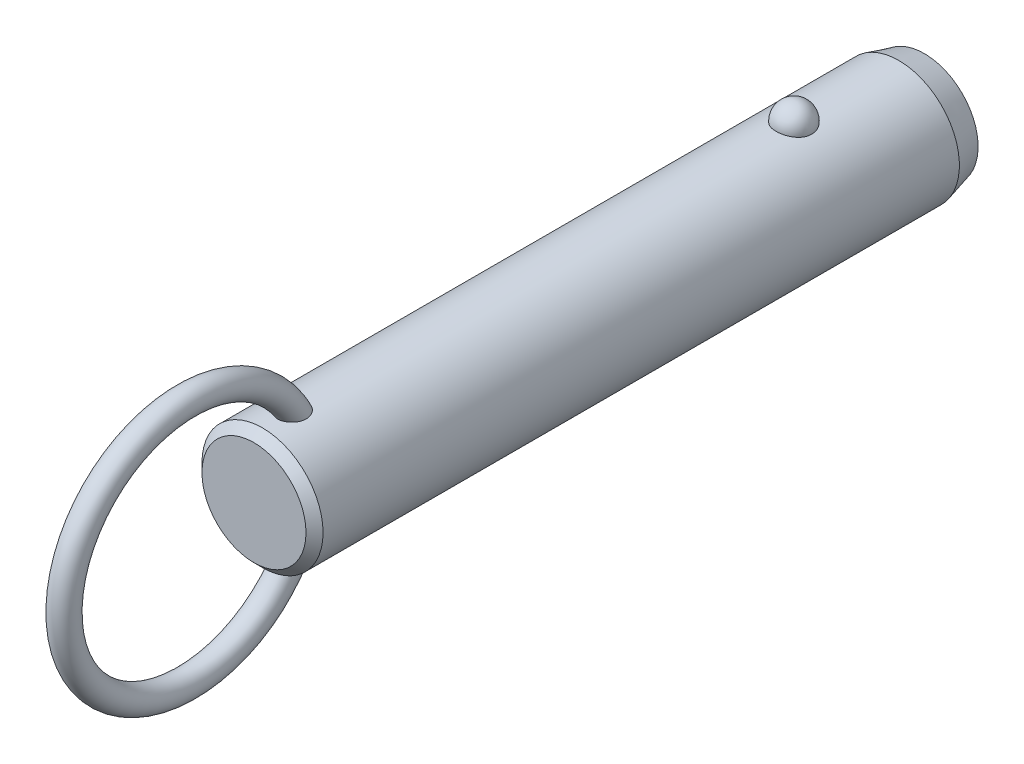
ISO-10303-21;
HEADER;
FILE_DESCRIPTION(('STEP AP214'),'2;1');
FILE_NAME('part.step','',(''),(''),'','','');
FILE_SCHEMA(('AUTOMOTIVE_DESIGN { 1 0 10303 214 1 1 1 1 }'));
ENDSEC;
DATA;
#1=APPLICATION_CONTEXT('core data for automotive mechanical design processes');
#2=APPLICATION_PROTOCOL_DEFINITION('international standard','automotive_design',2000,#1);
#3=PRODUCT_CONTEXT('',#1,'mechanical');
#4=PRODUCT('Part','Part','',(#3));
#5=PRODUCT_RELATED_PRODUCT_CATEGORY('part','',(#4));
#6=PRODUCT_DEFINITION_FORMATION('','',#4);
#7=PRODUCT_DEFINITION_CONTEXT('part definition',#1,'design');
#8=PRODUCT_DEFINITION('design','',#6,#7);
#9=PRODUCT_DEFINITION_SHAPE('','',#8);
#10=(LENGTH_UNIT() NAMED_UNIT(*) SI_UNIT(.MILLI.,.METRE.));
#11=(NAMED_UNIT(*) PLANE_ANGLE_UNIT() SI_UNIT($,.RADIAN.));
#12=(NAMED_UNIT(*) SI_UNIT($,.STERADIAN.) SOLID_ANGLE_UNIT());
#13=UNCERTAINTY_MEASURE_WITH_UNIT(LENGTH_MEASURE(1.E-05),#10,'distance_accuracy_value','');
#14=(GEOMETRIC_REPRESENTATION_CONTEXT(3) GLOBAL_UNCERTAINTY_ASSIGNED_CONTEXT((#13)) GLOBAL_UNIT_ASSIGNED_CONTEXT((#10,
#11,#12)) REPRESENTATION_CONTEXT('',''));
#15=CARTESIAN_POINT('',(0.,0.,0.));
#16=DIRECTION('',(0.,0.,1.));
#17=DIRECTION('',(1.,0.,0.));
#18=AXIS2_PLACEMENT_3D('',#15,#16,#17);
#19=CARTESIAN_POINT('',(0.,0.,53.3));
#20=DIRECTION('',(0.,0.,-1.));
#21=DIRECTION('',(-1.,0.,0.));
#22=AXIS2_PLACEMENT_3D('',#19,#20,#21);
#23=CYLINDRICAL_SURFACE('',#22,7.1);
#24=CARTESIAN_POINT('',(2.0769088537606,6.78943661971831,-2.1));
#25=CARTESIAN_POINT('',(2.07690739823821,6.78943796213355,-1.98268154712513));
#26=CARTESIAN_POINT('',(2.06738130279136,6.79237331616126,-1.86534506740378));
#27=CARTESIAN_POINT('',(2.0295040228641,6.8037853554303,-1.63400788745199));
#28=CARTESIAN_POINT('',(2.00114757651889,6.81226358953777,-1.52000812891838));
#29=CARTESIAN_POINT('',(1.92632025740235,6.83379798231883,-1.29863433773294));
#30=CARTESIAN_POINT('',(1.87985726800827,6.84685214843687,-1.19125744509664));
#31=CARTESIAN_POINT('',(1.76995205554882,6.87608091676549,-0.98604657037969));
#32=CARTESIAN_POINT('',(1.70650980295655,6.8922555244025,-0.88821260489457));
#33=CARTESIAN_POINT('',(1.5638119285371,6.92602930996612,-0.704242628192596));
#34=CARTESIAN_POINT('',(1.4844714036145,6.94363582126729,-0.618173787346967));
#35=CARTESIAN_POINT('',(1.31221746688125,6.97823658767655,-0.460740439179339));
#36=CARTESIAN_POINT('',(1.21930409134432,6.99523084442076,-0.389375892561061));
#37=CARTESIAN_POINT('',(1.02268781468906,7.02666176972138,-0.263547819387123));
#38=CARTESIAN_POINT('',(0.91902009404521,7.04110638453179,-0.209031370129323));
#39=CARTESIAN_POINT('',(0.703548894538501,7.06588726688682,-0.118163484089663));
#40=CARTESIAN_POINT('',(0.591746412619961,7.07622403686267,-0.0818098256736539));
#41=CARTESIAN_POINT('',(0.365557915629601,7.09147068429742,-0.0288711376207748));
#42=CARTESIAN_POINT('',(0.251267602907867,7.09648447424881,-0.0119070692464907));
#43=CARTESIAN_POINT('',(0.0213499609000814,7.10089837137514,0.00304925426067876));
#44=CARTESIAN_POINT('',(-0.0942772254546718,7.10029907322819,0.00104351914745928));
#45=CARTESIAN_POINT('',(-0.321651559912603,7.09360829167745,-0.0216931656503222));
#46=CARTESIAN_POINT('',(-0.433431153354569,7.08760388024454,-0.0421272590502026));
#47=CARTESIAN_POINT('',(-0.651862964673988,7.07086131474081,-0.100729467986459));
#48=CARTESIAN_POINT('',(-0.758515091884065,7.06012307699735,-0.138897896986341));
#49=CARTESIAN_POINT('',(-0.964449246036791,7.03496097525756,-0.232213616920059));
#50=CARTESIAN_POINT('',(-1.06368095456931,7.02051445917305,-0.287465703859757));
#51=CARTESIAN_POINT('',(-1.25145353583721,6.98948740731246,-0.413383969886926));
#52=CARTESIAN_POINT('',(-1.33999321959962,6.97290663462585,-0.48405186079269));
#53=CARTESIAN_POINT('',(-1.50591604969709,6.93898770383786,-0.640594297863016));
#54=CARTESIAN_POINT('',(-1.58302488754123,6.92164094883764,-0.726757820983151));
#55=CARTESIAN_POINT('',(-1.72189320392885,6.8884103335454,-0.91092752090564));
#56=CARTESIAN_POINT('',(-1.78365144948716,6.87252659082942,-1.008934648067));
#57=CARTESIAN_POINT('',(-1.89101272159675,6.84377189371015,-1.21549497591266));
#58=CARTESIAN_POINT('',(-1.93639553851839,6.83094274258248,-1.32416860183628));
#59=CARTESIAN_POINT('',(-2.00874275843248,6.81002070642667,-1.54791500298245));
#60=CARTESIAN_POINT('',(-2.03570774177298,6.80192767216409,-1.66298757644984));
#61=CARTESIAN_POINT('',(-2.07047276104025,6.7914266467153,-1.89571453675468));
#62=CARTESIAN_POINT('',(-2.07835878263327,6.78899315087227,-2.01335491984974));
#63=CARTESIAN_POINT('',(-2.07502083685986,6.79001409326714,-2.24833570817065));
#64=CARTESIAN_POINT('',(-2.06379746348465,6.7934683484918,-2.36567612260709));
#65=CARTESIAN_POINT('',(-2.02263913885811,6.80583442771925,-2.59603194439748));
#66=CARTESIAN_POINT('',(-1.99281127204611,6.81471501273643,-2.70906820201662));
#67=CARTESIAN_POINT('',(-1.91526639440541,6.83691232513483,-2.92836575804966));
#68=CARTESIAN_POINT('',(-1.8675486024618,6.85022924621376,-3.03462676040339));
#69=CARTESIAN_POINT('',(-1.75504492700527,6.87991336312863,-3.23806487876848));
#70=CARTESIAN_POINT('',(-1.69015924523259,6.89629822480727,-3.33518422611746));
#71=CARTESIAN_POINT('',(-1.54505404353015,6.93024852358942,-3.51697105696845));
#72=CARTESIAN_POINT('',(-1.46483385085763,6.94781401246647,-3.60163799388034));
#73=CARTESIAN_POINT('',(-1.29071406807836,6.98225977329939,-3.75654119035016));
#74=CARTESIAN_POINT('',(-1.19675650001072,6.99913673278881,-3.82671308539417));
#75=CARTESIAN_POINT('',(-0.997940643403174,7.03023618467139,-3.9501837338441));
#76=CARTESIAN_POINT('',(-0.89308318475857,7.04445887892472,-4.00348377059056));
#77=CARTESIAN_POINT('',(-0.676902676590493,7.06848365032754,-4.09107242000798));
#78=CARTESIAN_POINT('',(-0.565686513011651,7.0783430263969,-4.12560889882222));
#79=CARTESIAN_POINT('',(-0.338739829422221,7.09282534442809,-4.17575450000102));
#80=CARTESIAN_POINT('',(-0.223009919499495,7.09744899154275,-4.19136617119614));
#81=CARTESIAN_POINT('',(0.00707628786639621,7.10090930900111,-4.20307965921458));
#82=CARTESIAN_POINT('',(0.121410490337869,7.09986531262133,-4.19958377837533));
#83=CARTESIAN_POINT('',(0.347815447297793,7.092380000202,-4.17411564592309));
#84=CARTESIAN_POINT('',(0.459886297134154,7.08593891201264,-4.15214417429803));
#85=CARTESIAN_POINT('',(0.678084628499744,7.06838983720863,-4.09049562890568));
#86=CARTESIAN_POINT('',(0.784237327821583,7.05730369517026,-4.05090137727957));
#87=CARTESIAN_POINT('',(0.988305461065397,7.03163139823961,-3.95511447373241));
#88=CARTESIAN_POINT('',(1.08622031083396,7.01704499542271,-3.89892064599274));
#89=CARTESIAN_POINT('',(1.27284490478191,6.98562668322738,-3.77035541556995));
#90=CARTESIAN_POINT('',(1.36137372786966,6.96876135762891,-3.69772964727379));
#91=CARTESIAN_POINT('',(1.52509486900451,6.93477412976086,-3.53878279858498));
#92=CARTESIAN_POINT('',(1.60028496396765,6.91765218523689,-3.45245943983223));
#93=CARTESIAN_POINT('',(1.73681688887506,6.88465753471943,-3.26658774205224));
#94=CARTESIAN_POINT('',(1.79785966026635,6.86881574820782,-3.16681408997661));
#95=CARTESIAN_POINT('',(1.90265327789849,6.84053157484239,-2.95814408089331));
#96=CARTESIAN_POINT('',(1.94640861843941,6.82808830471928,-2.84925010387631));
#97=CARTESIAN_POINT('',(2.01274378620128,6.80881460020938,-2.63454318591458));
#98=CARTESIAN_POINT('',(2.03676193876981,6.80160856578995,-2.52920574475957));
#99=CARTESIAN_POINT('',(2.06884490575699,6.79191902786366,-2.3159172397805));
#100=CARTESIAN_POINT('',(2.07691019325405,6.78943538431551,-2.20796625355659));
#101=CARTESIAN_POINT('',(2.0769088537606,6.78943661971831,-2.1));
#102=B_SPLINE_CURVE_WITH_KNOTS('',3,(#24,#25,#26,#27,#28,#29,#30,#31,#32,#33,#34,#35,#36,#37,
#38,#39,#40,#41,#42,#43,#44,#45,#46,#47,#48,#49,#50,#51,#52,#53,#54,#55,#56,#57,#58,#59,#60,#61,
#62,#63,#64,#65,#66,#67,#68,#69,#70,#71,#72,#73,#74,#75,#76,#77,#78,#79,#80,#81,#82,#83,#84,#85,
#86,#87,#88,#89,#90,#91,#92,#93,#94,#95,#96,#97,#98,#99,#100,#101),.UNSPECIFIED.,.T.,.F.,(4,2,2,
2,2,2,2,2,2,2,2,2,2,2,2,2,2,2,2,2,2,2,2,2,2,2,2,2,2,2,2,2,2,2,2,2,2,2,4),(0.,0.351568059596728,
0.703234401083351,1.05474780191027,1.40626181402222,1.75970563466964,2.11314851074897,
2.4654696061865,2.81774759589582,3.16301449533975,3.50824481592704,3.84801136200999,
4.18778391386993,4.52968352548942,4.87162112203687,5.22076181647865,5.56993054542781,
5.92363364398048,6.27732559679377,6.62942052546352,6.98150450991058,7.33158042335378,
7.68167162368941,8.03384443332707,8.38603269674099,8.73975272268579,9.09344583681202,
9.44234545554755,9.79119807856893,10.1327344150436,10.4742563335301,10.8141898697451,
11.1541474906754,11.4997793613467,11.8454687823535,12.1979079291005,12.5502553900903,
12.8738073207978,13.1973496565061),.UNSPECIFIED.);
#103=CARTESIAN_POINT('',(2.0769088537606,6.78943661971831,-2.1));
#104=VERTEX_POINT('',#103);
#105=EDGE_CURVE('E41',#104,#104,#102,.T.);
#106=ORIENTED_EDGE('',*,*,#105,.T.);
#107=EDGE_LOOP('',(#106));
#108=FACE_BOUND('',#107,.T.);
#109=CARTESIAN_POINT('',(0.,0.,60.22));
#110=DIRECTION('',(0.,0.,1.));
#111=DIRECTION('',(1.,0.,0.));
#112=AXIS2_PLACEMENT_3D('',#109,#110,#111);
#113=CIRCLE('',#112,7.1);
#114=CARTESIAN_POINT('',(7.1,0.,60.22));
#115=VERTEX_POINT('',#114);
#116=EDGE_CURVE('E10',#115,#115,#113,.F.);
#117=ORIENTED_EDGE('',*,*,#116,.T.);
#118=EDGE_LOOP('',(#117));
#119=FACE_BOUND('',#118,.T.);
#120=CARTESIAN_POINT('',(-0.429539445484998,-7.08699541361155,55.0429212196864));
#121=CARTESIAN_POINT('',(-0.50833166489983,-7.08221999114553,55.0668764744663));
#122=CARTESIAN_POINT('',(-0.585039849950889,-7.07624016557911,55.0974570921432));
#123=CARTESIAN_POINT('',(-0.732082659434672,-7.06254296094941,55.1710242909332));
#124=CARTESIAN_POINT('',(-0.802417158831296,-7.05482554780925,55.2140111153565));
#125=CARTESIAN_POINT('',(-0.934722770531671,-7.03851844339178,55.3111135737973));
#126=CARTESIAN_POINT('',(-0.996700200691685,-7.02992941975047,55.3652207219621));
#127=CARTESIAN_POINT('',(-1.11079942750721,-7.01280697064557,55.4829676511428));
#128=CARTESIAN_POINT('',(-1.16292136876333,-7.00427354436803,55.5466072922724));
#129=CARTESIAN_POINT('',(-1.25705660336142,-6.98799959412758,55.6826870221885));
#130=CARTESIAN_POINT('',(-1.29888032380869,-6.98027525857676,55.7552598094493));
#131=CARTESIAN_POINT('',(-1.37069920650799,-6.96652886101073,55.9061686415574));
#132=CARTESIAN_POINT('',(-1.40069157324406,-6.96050720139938,55.9845060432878));
#133=CARTESIAN_POINT('',(-1.45043507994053,-6.95031881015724,56.1501903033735));
#134=CARTESIAN_POINT('',(-1.46937115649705,-6.94630231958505,56.2377897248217));
#135=CARTESIAN_POINT('',(-1.49424917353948,-6.94099239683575,56.4148714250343));
#136=CARTESIAN_POINT('',(-1.50018601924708,-6.93970003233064,56.5043544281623));
#137=CARTESIAN_POINT('',(-1.49978214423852,-6.93978815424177,56.6940607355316));
#138=CARTESIAN_POINT('',(-1.49187639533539,-6.94150934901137,56.794279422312));
#139=CARTESIAN_POINT('',(-1.46177925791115,-6.94790814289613,56.9924798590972));
#140=CARTESIAN_POINT('',(-1.43957541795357,-6.95258831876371,57.090459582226));
#141=CARTESIAN_POINT('',(-1.37783293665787,-6.96510647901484,57.2953629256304));
#142=CARTESIAN_POINT('',(-1.33634073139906,-6.97328848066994,57.4016801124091));
#143=CARTESIAN_POINT('',(-1.23686994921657,-6.99161706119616,57.6061777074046));
#144=CARTESIAN_POINT('',(-1.17889192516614,-7.00176357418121,57.7043583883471));
#145=CARTESIAN_POINT('',(-1.0587512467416,-7.02082898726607,57.8723743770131));
#146=CARTESIAN_POINT('',(-0.999247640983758,-7.02963746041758,57.9441230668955));
#147=CARTESIAN_POINT('',(-0.86949477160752,-7.04686074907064,58.0771959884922));
#148=CARTESIAN_POINT('',(-0.799263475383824,-7.05527619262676,58.1385372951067));
#149=CARTESIAN_POINT('',(-0.665408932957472,-7.06899457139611,58.2351316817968));
#150=CARTESIAN_POINT('',(-0.603817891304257,-7.07457275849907,58.2731512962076));
#151=CARTESIAN_POINT('',(-0.475172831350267,-7.08437420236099,58.3387581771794));
#152=CARTESIAN_POINT('',(-0.40812301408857,-7.08859848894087,58.3663533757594));
#153=CARTESIAN_POINT('',(-0.269431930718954,-7.09522749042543,58.4092569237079));
#154=CARTESIAN_POINT('',(-0.197757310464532,-7.09761688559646,58.4244618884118));
#155=CARTESIAN_POINT('',(-0.0527849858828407,-7.10017268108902,58.4407168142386));
#156=CARTESIAN_POINT('',(0.0205115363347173,-7.10034065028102,58.4417767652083));
#157=CARTESIAN_POINT('',(0.156426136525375,-7.09855986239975,58.4304619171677));
#158=CARTESIAN_POINT('',(0.219199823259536,-7.09688191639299,58.4198060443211));
#159=CARTESIAN_POINT('',(0.342134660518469,-7.09201880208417,58.3885379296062));
#160=CARTESIAN_POINT('',(0.402295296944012,-7.08883333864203,58.3679237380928));
#161=CARTESIAN_POINT('',(0.520687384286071,-7.08113868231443,58.3172125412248));
#162=CARTESIAN_POINT('',(0.578791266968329,-7.07658958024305,58.2868272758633));
#163=CARTESIAN_POINT('',(0.690173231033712,-7.06659708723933,58.2183678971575));
#164=CARTESIAN_POINT('',(0.743447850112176,-7.061153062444,58.1802883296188));
#165=CARTESIAN_POINT('',(0.870947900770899,-7.04680292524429,58.0765929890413));
#166=CARTESIAN_POINT('',(0.941828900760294,-7.0375580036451,58.0068972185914));
#167=CARTESIAN_POINT('',(1.07136606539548,-7.01900793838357,57.8569450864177));
#168=CARTESIAN_POINT('',(1.13000013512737,-7.00970271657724,57.7766700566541));
#169=CARTESIAN_POINT('',(1.23579584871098,-6.99183327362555,57.6068997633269));
#170=CARTESIAN_POINT('',(1.2827427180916,-6.98328455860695,57.5172696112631));
#171=CARTESIAN_POINT('',(1.36351442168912,-6.96796352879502,57.3321763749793));
#172=CARTESIAN_POINT('',(1.39733971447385,-6.96119115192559,57.2367134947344));
#173=CARTESIAN_POINT('',(1.45579181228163,-6.94922464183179,57.0253092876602));
#174=CARTESIAN_POINT('',(1.47790145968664,-6.94449000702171,56.908631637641));
#175=CARTESIAN_POINT('',(1.50168752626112,-6.93938731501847,56.6730153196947));
#176=CARTESIAN_POINT('',(1.50336085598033,-6.93901991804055,56.5540763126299));
#177=CARTESIAN_POINT('',(1.48486516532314,-6.9430010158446,56.3236079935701));
#178=CARTESIAN_POINT('',(1.46573441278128,-6.9471253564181,56.211995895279));
#179=CARTESIAN_POINT('',(1.40606892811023,-6.95944667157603,55.9948868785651));
#180=CARTESIAN_POINT('',(1.36556446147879,-6.96763788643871,55.8893815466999));
#181=CARTESIAN_POINT('',(1.27082700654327,-6.98548038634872,55.7042879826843));
#182=CARTESIAN_POINT('',(1.21949810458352,-6.99473841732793,55.6231719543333));
#183=CARTESIAN_POINT('',(1.10242050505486,-7.01414069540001,55.4722278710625));
#184=CARTESIAN_POINT('',(1.03668119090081,-7.02428436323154,55.4023925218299));
#185=CARTESIAN_POINT('',(0.90055902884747,-7.04295285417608,55.2835735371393));
#186=CARTESIAN_POINT('',(0.831428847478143,-7.05153466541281,55.2331573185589));
#187=CARTESIAN_POINT('',(0.685291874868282,-7.06723150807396,55.1451429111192));
#188=CARTESIAN_POINT('',(0.608287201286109,-7.0743469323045,55.1075412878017));
#189=CARTESIAN_POINT('',(0.451878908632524,-7.08602232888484,55.0474915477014));
#190=CARTESIAN_POINT('',(0.372686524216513,-7.09067127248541,55.0245088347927));
#191=CARTESIAN_POINT('',(0.211477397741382,-7.09730788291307,54.9920357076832));
#192=CARTESIAN_POINT('',(0.129460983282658,-7.09929585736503,54.9825437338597));
#193=CARTESIAN_POINT('',(-0.0332905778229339,-7.10037858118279,54.9773517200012));
#194=CARTESIAN_POINT('',(-0.114016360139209,-7.09953334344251,54.9813656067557));
#195=CARTESIAN_POINT('',(-0.273670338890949,-7.09517338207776,55.0024540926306));
#196=CARTESIAN_POINT('',(-0.352598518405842,-7.09165863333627,55.0195288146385));
#197=CARTESIAN_POINT('',(-0.429539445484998,-7.08699541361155,55.0429212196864));
#198=B_SPLINE_CURVE_WITH_KNOTS('',3,(#120,#121,#122,#123,#124,#125,#126,#127,#128,#129,#130,
#131,#132,#133,#134,#135,#136,#137,#138,#139,#140,#141,#142,#143,#144,#145,#146,#147,#148,#149,
#150,#151,#152,#153,#154,#155,#156,#157,#158,#159,#160,#161,#162,#163,#164,#165,#166,#167,#168,
#169,#170,#171,#172,#173,#174,#175,#176,#177,#178,#179,#180,#181,#182,#183,#184,#185,#186,#187,
#188,#189,#190,#191,#192,#193,#194,#195,#196,#197),.UNSPECIFIED.,.T.,.F.,(4,2,2,2,2,2,2,2,2,2,2,
2,2,2,2,2,2,2,2,2,2,2,2,2,2,2,2,2,2,2,2,2,2,2,2,2,2,2,4),(0.,0.247183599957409,
0.494372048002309,0.741372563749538,0.98836945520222,1.23962059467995,1.49093106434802,
1.75897818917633,2.02713035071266,2.32758265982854,2.62829697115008,2.97008736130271,
3.31186629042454,3.5917531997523,3.87117637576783,4.08813841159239,4.30493502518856,
4.52352259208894,4.74195577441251,4.93215328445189,5.12238804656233,5.31884850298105,
5.51544871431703,5.8133231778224,6.11173048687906,6.41527266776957,6.7188042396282,
7.07358156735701,7.42841252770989,7.76631485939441,8.10373999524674,8.39142246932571,
8.67891817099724,8.93560332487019,9.19221962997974,9.43881106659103,9.68537399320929,
9.92674752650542,10.1681233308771),.UNSPECIFIED.);
#199=CARTESIAN_POINT('',(-0.429539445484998,-7.08699541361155,55.0429212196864));
#200=VERTEX_POINT('',#199);
#201=EDGE_CURVE('E60',#200,#200,#198,.T.);
#202=ORIENTED_EDGE('',*,*,#201,.T.);
#203=EDGE_LOOP('',(#202));
#204=FACE_BOUND('',#203,.T.);
#205=CARTESIAN_POINT('',(-0.429539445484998,7.08699541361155,55.0429212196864));
#206=CARTESIAN_POINT('',(-0.351665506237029,7.09171429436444,55.0192469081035));
#207=CARTESIAN_POINT('',(-0.271733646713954,7.09525896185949,55.0020369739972));
#208=CARTESIAN_POINT('',(-0.110026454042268,7.09960839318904,54.9810059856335));
#209=CARTESIAN_POINT('',(-0.0282502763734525,7.10041187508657,54.977191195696));
#210=CARTESIAN_POINT('',(0.134782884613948,7.09918849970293,54.983059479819));
#211=CARTESIAN_POINT('',(0.216039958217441,7.09716214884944,54.9927401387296));
#212=CARTESIAN_POINT('',(0.375730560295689,7.09050177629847,55.0253471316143));
#213=CARTESIAN_POINT('',(0.454164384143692,7.08586802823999,55.0482720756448));
#214=CARTESIAN_POINT('',(0.606025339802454,7.07449911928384,55.106771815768));
#215=CARTESIAN_POINT('',(0.679451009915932,7.06776334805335,55.1423502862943));
#216=CARTESIAN_POINT('',(0.819234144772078,7.05292866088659,55.2251753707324));
#217=CARTESIAN_POINT('',(0.885591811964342,7.04482978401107,55.2724216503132));
#218=CARTESIAN_POINT('',(1.00993211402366,7.02808709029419,55.3775902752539));
#219=CARTESIAN_POINT('',(1.06785399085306,7.01943990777,55.435583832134));
#220=CARTESIAN_POINT('',(1.17342527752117,7.00256662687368,55.5603013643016));
#221=CARTESIAN_POINT('',(1.22107408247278,6.99434055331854,55.6270258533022));
#222=CARTESIAN_POINT('',(1.30652927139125,6.97889183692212,55.7693622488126));
#223=CARTESIAN_POINT('',(1.34399711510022,6.97170674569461,55.8451808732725));
#224=CARTESIAN_POINT('',(1.40682616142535,6.95930080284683,56.0018100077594));
#225=CARTESIAN_POINT('',(1.43218374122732,6.95408053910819,56.0826220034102));
#226=CARTESIAN_POINT('',(1.47246409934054,6.94566853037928,56.2535314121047));
#227=CARTESIAN_POINT('',(1.48642590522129,6.9426653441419,56.3438630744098));
#228=CARTESIAN_POINT('',(1.5011410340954,6.93949744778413,56.525619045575));
#229=CARTESIAN_POINT('',(1.50188917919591,6.93933385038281,56.6170437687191));
#230=CARTESIAN_POINT('',(1.49030464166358,6.94183245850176,56.8108438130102));
#231=CARTESIAN_POINT('',(1.47627413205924,6.94486147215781,56.913112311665));
#232=CARTESIAN_POINT('',(1.43356351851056,6.95380194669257,57.1144719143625));
#233=CARTESIAN_POINT('',(1.4048676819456,6.95971650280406,57.2135594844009));
#234=CARTESIAN_POINT('',(1.32908750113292,6.97461208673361,57.4189087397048));
#235=CARTESIAN_POINT('',(1.28011435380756,6.98388945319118,57.5244566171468));
#236=CARTESIAN_POINT('',(1.16520357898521,7.00397743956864,57.7257604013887));
#237=CARTESIAN_POINT('',(1.09927694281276,7.01478706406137,57.8215225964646));
#238=CARTESIAN_POINT('',(0.969361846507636,7.03373936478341,57.9767565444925));
#239=CARTESIAN_POINT('',(0.909042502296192,7.04187023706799,58.0393032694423));
#240=CARTESIAN_POINT('',(0.779178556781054,7.05741732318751,58.1540535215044));
#241=CARTESIAN_POINT('',(0.709649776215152,7.06483472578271,58.2062744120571));
#242=CARTESIAN_POINT('',(0.576854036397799,7.0767751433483,58.2881138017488));
#243=CARTESIAN_POINT('',(0.515118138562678,7.08158033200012,58.3201641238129));
#244=CARTESIAN_POINT('',(0.387127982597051,7.08972701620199,58.3737656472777));
#245=CARTESIAN_POINT('',(0.320877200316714,7.09306962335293,58.3953248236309));
#246=CARTESIAN_POINT('',(0.185041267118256,7.09791507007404,58.4264005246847));
#247=CARTESIAN_POINT('',(0.115437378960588,7.09940591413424,58.4358385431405));
#248=CARTESIAN_POINT('',(-0.0243157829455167,7.10030171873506,58.4415226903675));
#249=CARTESIAN_POINT('',(-0.094464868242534,7.0997073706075,58.4377731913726));
#250=CARTESIAN_POINT('',(-0.225713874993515,7.09668414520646,58.4185081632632));
#251=CARTESIAN_POINT('',(-0.287006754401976,7.09444865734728,58.4042323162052));
#252=CARTESIAN_POINT('',(-0.406555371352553,7.08860360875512,58.3663685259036));
#253=CARTESIAN_POINT('',(-0.464809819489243,7.08499346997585,58.3427766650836));
#254=CARTESIAN_POINT('',(-0.594955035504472,7.07541654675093,58.2789232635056));
#255=CARTESIAN_POINT('',(-0.665389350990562,7.06906574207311,58.235753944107));
#256=CARTESIAN_POINT('',(-0.798242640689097,7.05530261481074,58.138587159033));
#257=CARTESIAN_POINT('',(-0.860645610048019,7.0478882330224,58.0845686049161));
#258=CARTESIAN_POINT('',(-0.99424943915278,7.03045217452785,57.9509965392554));
#259=CARTESIAN_POINT('',(-1.06260129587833,7.02030745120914,57.8686143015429));
#260=CARTESIAN_POINT('',(-1.18502045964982,7.00068382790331,57.693843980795));
#261=CARTESIAN_POINT('',(-1.239076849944,6.99120544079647,57.601448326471));
#262=CARTESIAN_POINT('',(-1.33335589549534,6.97384343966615,57.4080085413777));
#263=CARTESIAN_POINT('',(-1.3733613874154,6.96598557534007,57.3068564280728));
#264=CARTESIAN_POINT('',(-1.43770677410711,6.9529905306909,57.0995046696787));
#265=CARTESIAN_POINT('',(-1.46204473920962,6.94785368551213,56.99330440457));
#266=CARTESIAN_POINT('',(-1.49537533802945,6.94076296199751,56.768231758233));
#267=CARTESIAN_POINT('',(-1.50273564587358,6.93914842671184,56.6490975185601));
#268=CARTESIAN_POINT('',(-1.4954555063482,6.94072368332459,56.4114703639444));
#269=CARTESIAN_POINT('',(-1.48082914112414,6.94391040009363,56.2929770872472));
#270=CARTESIAN_POINT('',(-1.43076401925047,6.95438579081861,56.0734325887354));
#271=CARTESIAN_POINT('',(-1.39762227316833,6.96121852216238,55.9718413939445));
#272=CARTESIAN_POINT('',(-1.31211274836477,6.97783941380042,55.7773513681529));
#273=CARTESIAN_POINT('',(-1.25976607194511,6.98762432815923,55.6844431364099));
#274=CARTESIAN_POINT('',(-1.14583073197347,7.00713153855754,55.5241601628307));
#275=CARTESIAN_POINT('',(-1.08665947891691,7.01665982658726,55.4550351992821));
#276=CARTESIAN_POINT('',(-0.956606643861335,7.03556646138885,55.3288786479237));
#277=CARTESIAN_POINT('',(-0.885737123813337,7.04494495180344,55.2718347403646));
#278=CARTESIAN_POINT('',(-0.751558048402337,7.06035735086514,55.1831004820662));
#279=CARTESIAN_POINT('',(-0.690120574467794,7.0666695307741,55.1485932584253));
#280=CARTESIAN_POINT('',(-0.562815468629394,7.07794609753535,55.0887507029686));
#281=CARTESIAN_POINT('',(-0.496948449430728,7.08291067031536,55.0634141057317));
#282=CARTESIAN_POINT('',(-0.429539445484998,7.08699541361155,55.0429212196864));
#283=B_SPLINE_CURVE_WITH_KNOTS('',3,(#205,#206,#207,#208,#209,#210,#211,#212,#213,#214,#215,
#216,#217,#218,#219,#220,#221,#222,#223,#224,#225,#226,#227,#228,#229,#230,#231,#232,#233,#234,
#235,#236,#237,#238,#239,#240,#241,#242,#243,#244,#245,#246,#247,#248,#249,#250,#251,#252,#253,
#254,#255,#256,#257,#258,#259,#260,#261,#262,#263,#264,#265,#266,#267,#268,#269,#270,#271,#272,
#273,#274,#275,#276,#277,#278,#279,#280,#281,#282),.UNSPECIFIED.,.T.,.F.,(4,2,2,2,2,2,2,2,2,2,2,
2,2,2,2,2,2,2,2,2,2,2,2,2,2,2,2,2,2,2,2,2,2,2,2,2,2,2,4),(0.,0.244335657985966,
0.488785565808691,0.733191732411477,0.977572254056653,1.22202379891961,1.46646834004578,
1.71259457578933,1.9587352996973,2.21226768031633,2.46587585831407,2.73913816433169,
3.01250754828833,3.32109936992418,3.63002293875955,3.97863512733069,4.32702187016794,
4.58793945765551,4.84841449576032,5.05676704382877,5.26496096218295,5.47449661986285,
5.68396281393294,5.87205447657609,6.06022532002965,6.30743751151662,6.55513496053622,
6.87602468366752,7.19715875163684,7.52305774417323,7.84899686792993,8.20516155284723,
8.5610982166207,8.88040084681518,9.19935367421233,9.47236282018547,9.74509220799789,
9.95662250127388,10.1681235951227),.UNSPECIFIED.);
#284=CARTESIAN_POINT('',(-0.429539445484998,7.08699541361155,55.0429212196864));
#285=VERTEX_POINT('',#284);
#286=EDGE_CURVE('E67',#285,#285,#283,.T.);
#287=ORIENTED_EDGE('',*,*,#286,.T.);
#288=EDGE_LOOP('',(#287));
#289=FACE_BOUND('',#288,.T.);
#290=CARTESIAN_POINT('',(0.,0.,-14.4));
#291=DIRECTION('',(0.,0.,-1.));
#292=DIRECTION('',(-1.,0.,0.));
#293=AXIS2_PLACEMENT_3D('',#290,#291,#292);
#294=CIRCLE('',#293,7.1);
#295=CARTESIAN_POINT('',(-7.1,0.,-14.4));
#296=VERTEX_POINT('',#295);
#297=EDGE_CURVE('E57',#296,#296,#294,.F.);
#298=ORIENTED_EDGE('',*,*,#297,.T.);
#299=EDGE_LOOP('',(#298));
#300=FACE_BOUND('',#299,.T.);
#301=ADVANCED_FACE('F37',(#108,#119,#204,#289,#300),#23,.T.);
#302=CARTESIAN_POINT('',(0.,0.,-17.4));
#303=DIRECTION('',(0.,0.,-1.));
#304=DIRECTION('',(-1.,0.,0.));
#305=AXIS2_PLACEMENT_3D('',#302,#303,#304);
#306=PLANE('',#305);
#307=CARTESIAN_POINT('',(0.,0.,-17.4));
#308=DIRECTION('',(0.,0.,-1.));
#309=DIRECTION('',(-1.,0.,0.));
#310=AXIS2_PLACEMENT_3D('',#307,#308,#309);
#311=CIRCLE('',#310,6.29615242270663);
#312=CARTESIAN_POINT('',(-6.29615242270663,0.,-17.4));
#313=VERTEX_POINT('',#312);
#314=EDGE_CURVE('E66',#313,#313,#311,.T.);
#315=ORIENTED_EDGE('',*,*,#314,.T.);
#316=EDGE_LOOP('',(#315));
#317=FACE_BOUND('',#316,.T.);
#318=ADVANCED_FACE('F85',(#317),#306,.T.);
#319=CARTESIAN_POINT('',(0.,0.,-17.4));
#320=DIRECTION('',(0.,0.,1.));
#321=DIRECTION('',(1.,0.,0.));
#322=AXIS2_PLACEMENT_3D('',#319,#320,#321);
#323=CONICAL_SURFACE('',#322,6.29615242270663,0.261799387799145);
#324=ORIENTED_EDGE('',*,*,#297,.F.);
#325=EDGE_LOOP('',(#324));
#326=FACE_BOUND('',#325,.T.);
#327=ORIENTED_EDGE('',*,*,#314,.F.);
#328=EDGE_LOOP('',(#327));
#329=FACE_BOUND('',#328,.T.);
#330=ADVANCED_FACE('F83',(#326,#329),#323,.T.);
#331=CARTESIAN_POINT('',(0.,0.,61.22));
#332=DIRECTION('',(0.,0.,1.));
#333=DIRECTION('',(1.,0.,0.));
#334=AXIS2_PLACEMENT_3D('',#331,#332,#333);
#335=PLANE('',#334);
#336=CARTESIAN_POINT('',(0.,0.,61.22));
#337=DIRECTION('',(0.,0.,1.));
#338=DIRECTION('',(1.,0.,0.));
#339=AXIS2_PLACEMENT_3D('',#336,#337,#338);
#340=CIRCLE('',#339,6.10000000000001);
#341=CARTESIAN_POINT('',(6.10000000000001,0.,61.22));
#342=VERTEX_POINT('',#341);
#343=EDGE_CURVE('E50',#342,#342,#340,.T.);
#344=ORIENTED_EDGE('',*,*,#343,.T.);
#345=EDGE_LOOP('',(#344));
#346=FACE_BOUND('',#345,.T.);
#347=ADVANCED_FACE('F77',(#346),#335,.T.);
#348=CARTESIAN_POINT('',(0.,0.,69.15));
#349=DIRECTION('',(1.,0.,0.));
#350=DIRECTION('',(0.,0.,-1.));
#351=AXIS2_PLACEMENT_3D('',#348,#349,#350);
#352=TOROIDAL_SURFACE('',#351,14.35,1.5);
#353=ORIENTED_EDGE('',*,*,#286,.F.);
#354=EDGE_LOOP('',(#353));
#355=FACE_BOUND('',#354,.T.);
#356=ORIENTED_EDGE('',*,*,#201,.F.);
#357=EDGE_LOOP('',(#356));
#358=FACE_BOUND('',#357,.T.);
#359=ADVANCED_FACE('F73',(#355,#358),#352,.T.);
#360=CARTESIAN_POINT('',(0.,0.,61.22));
#361=DIRECTION('',(0.,0.,-1.));
#362=DIRECTION('',(-1.,0.,0.));
#363=AXIS2_PLACEMENT_3D('',#360,#361,#362);
#364=CONICAL_SURFACE('',#363,6.10000000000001,0.785398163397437);
#365=ORIENTED_EDGE('',*,*,#116,.F.);
#366=EDGE_LOOP('',(#365));
#367=FACE_BOUND('',#366,.T.);
#368=ORIENTED_EDGE('',*,*,#343,.F.);
#369=EDGE_LOOP('',(#368));
#370=FACE_BOUND('',#369,.T.);
#371=ADVANCED_FACE('F39',(#367,#370),#364,.T.);
#372=CARTESIAN_POINT('',(0.,7.1,-2.1));
#373=DIRECTION('',(0.,1.,0.));
#374=DIRECTION('',(0.,0.,1.));
#375=AXIS2_PLACEMENT_3D('',#372,#373,#374);
#376=SPHERICAL_SURFACE('',#375,2.10000000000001);
#377=ORIENTED_EDGE('',*,*,#105,.F.);
#378=EDGE_LOOP('',(#377));
#379=FACE_BOUND('',#378,.T.);
#380=ADVANCED_FACE('F79',(#379),#376,.T.);
#381=CLOSED_SHELL('',(#301,#318,#330,#347,#359,#371,#380));
#382=MANIFOLD_SOLID_BREP('B2',#381);
#383=ADVANCED_BREP_SHAPE_REPRESENTATION('',(#18,#382),#14);
#384=SHAPE_DEFINITION_REPRESENTATION(#9,#383);
ENDSEC;
END-ISO-10303-21;
